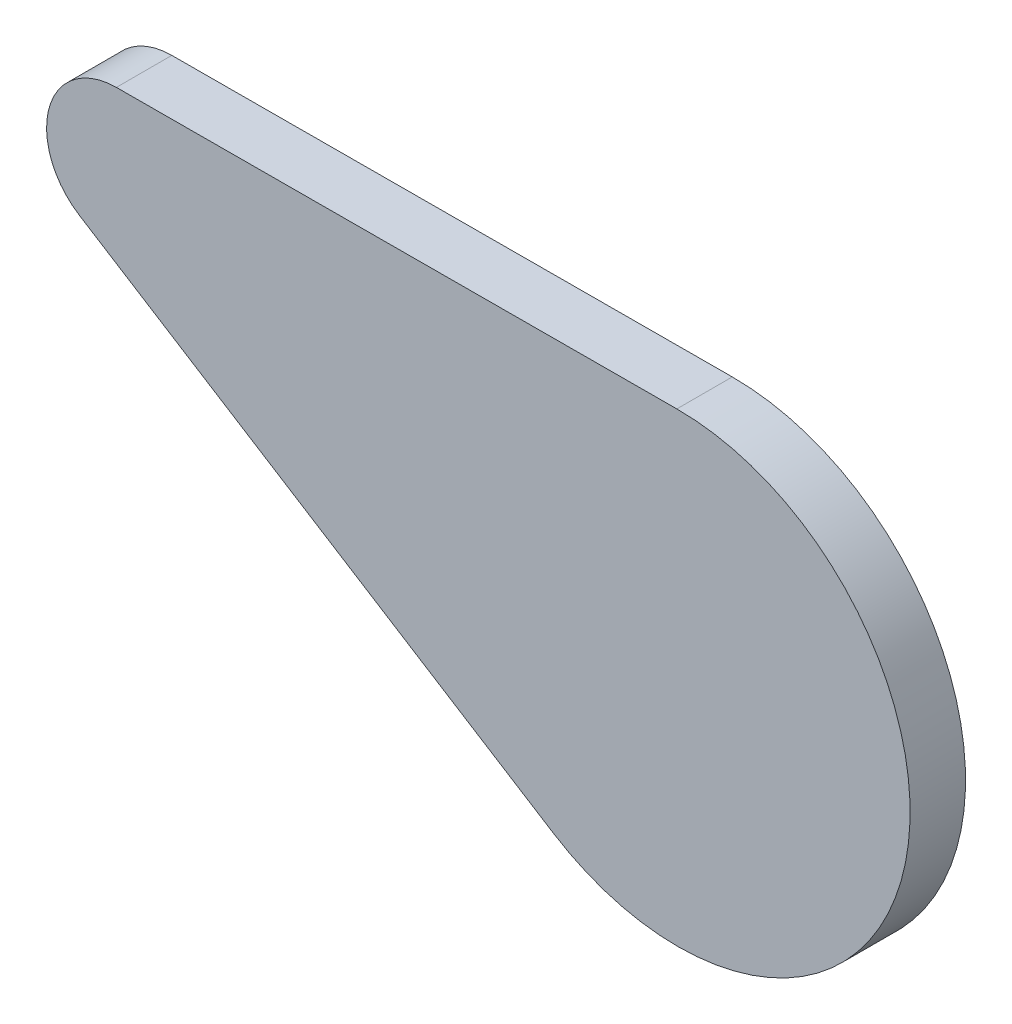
from build123d import *

# Parameters (mm, degrees)
BOSS_EXTRU_1_DEPTH = 10


with BuildPart() as part:
    # Esquisse2 → Boss.-Extru.1 (new body)
    with BuildSketch(Plane.XY):
        with BuildLine():
            Line((-22.332885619, -35.513514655), (-107.924267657, 18.31113671))
            ThreePointArc((-107.924267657, 18.31113671), (-113.341945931, 32.482116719), (-101.240728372, 41.632441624))
            Line((-101.240728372, 41.632441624), (-0.132490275, 41.951757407))
            ThreePointArc((-0.132490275, 41.951757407), (40.328530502, -11.557557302), (-22.332885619, -35.513514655))
        make_face()
    extrude(amount=-BOSS_EXTRU_1_DEPTH)


solid = part.part
